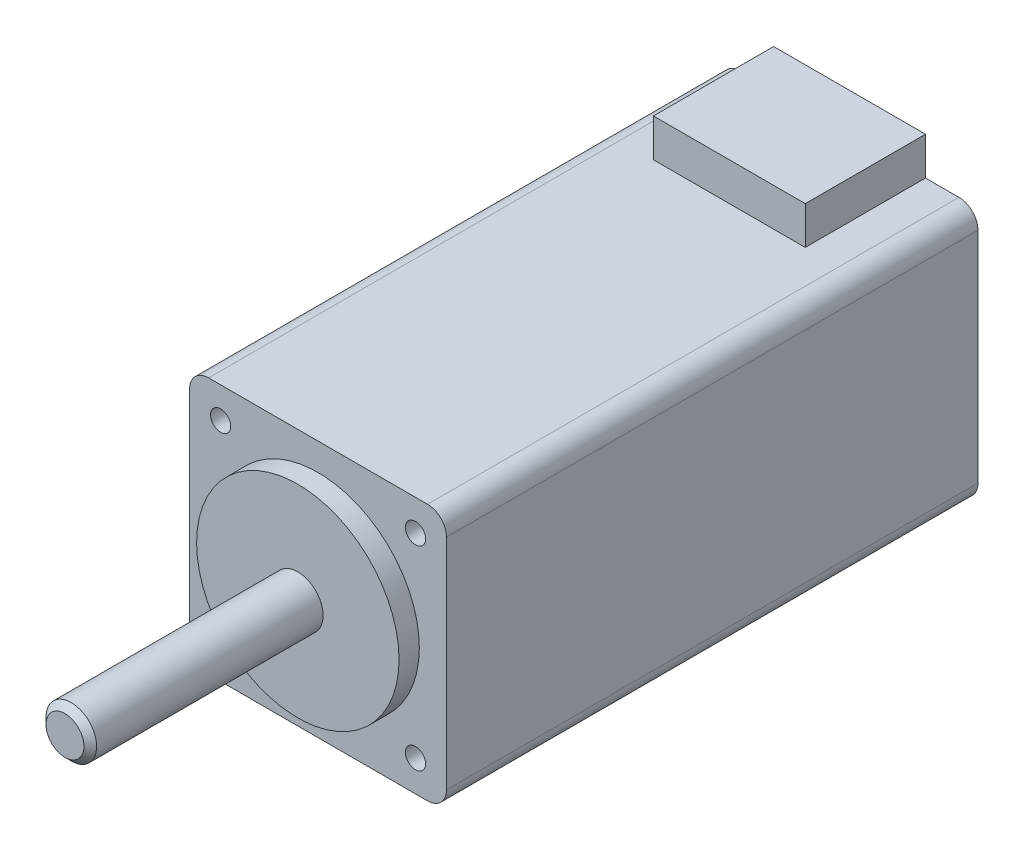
from build123d import *

# Parameters (mm, degrees)
SKETCH_1_R             = 8
EXTRUDE_1_DEPTH        = 1.6
SKETCH_2_R             = 2
EXTRUDE_2_DEPTH        = 18.4
CHAMFER_1_SIZE         = 0.5
EXTRUDE_3_DEPTH        = 42
EXTRUDE_4_DEPTH        = 9.5
HOLE_WIZARD_M2_1_D     = 1.6
HOLE_WIZARD_M2_1_DEPTH = 5.5
HOLE_WIZARD_M2_1_TIP   = 0.480688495


with BuildPart() as part:
    # Sketch 1 → Extrude 1 (new body)
    with BuildSketch(Plane.XY):
        Circle(SKETCH_1_R)
    extrude(amount=-EXTRUDE_1_DEPTH)

    # Sketch 2 → Extrude 2 (add)
    with BuildSketch(Plane.XY):
        Circle(SKETCH_2_R)
    extrude(amount=EXTRUDE_2_DEPTH)

    # Chamfer 1
    chamfer_1_edges = [part.edges().sort_by_distance(p)[0] for p in [
        (-2, 0, 18.4),
    ]]
    chamfer(chamfer_1_edges, length=CHAMFER_1_SIZE)

    # Sketch 4 → Extrude 3 (add)
    with BuildSketch(Plane(origin=(0, 0, -1.6), x_dir=(-1, 0, 0), z_dir=(0, 0, -1))):
        with BuildLine():
            Line((0, 10.15), (8.65, 10.15))
            ThreePointArc((8.65, 10.15), (9.710660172, 9.710660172), (10.15, 8.65))
            Line((10.15, 8.65), (10.15, -8.65))
            ThreePointArc((10.15, -8.65), (9.710660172, -9.710660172), (8.65, -10.15))
            Line((8.65, -10.15), (-8.65, -10.15))
            ThreePointArc((-8.65, -10.15), (-9.710660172, -9.710660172), (-10.15, -8.65))
            Line((-10.15, -8.65), (-10.15, 8.65))
            ThreePointArc((-10.15, 8.65), (-9.710660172, 9.710660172), (-8.65, 10.15))
            Line((-8.65, 10.15), (0, 10.15))
        make_face()
    extrude(amount=EXTRUDE_3_DEPTH)

    # Sketch 6 → Extrude 4 (add)
    with BuildSketch(Plane(origin=(0, 0, -43.6), x_dir=(-1, 0, 0), z_dir=(0, 0, -1))):
        Polygon((0, 10.15), (6, 10.15), (6, 13.15), (-6, 13.15), (-6, 10.15), align=None)
    extrude(amount=-EXTRUDE_4_DEPTH)

    # Hole Wizard M2 _1
    with Locations(Plane.XY.offset(-1.6)):
        with Locations((-7.7, 7.7), (7.7, 7.7), (7.7, -7.7), (-7.7, -7.7)):
            Hole(HOLE_WIZARD_M2_1_D / 2, depth=HOLE_WIZARD_M2_1_DEPTH)
            with Locations((0, 0, -(HOLE_WIZARD_M2_1_DEPTH + HOLE_WIZARD_M2_1_TIP / 2))):  # 118° drill point
                Cone(0, HOLE_WIZARD_M2_1_D / 2, HOLE_WIZARD_M2_1_TIP, mode=Mode.SUBTRACT)


solid = part.part
